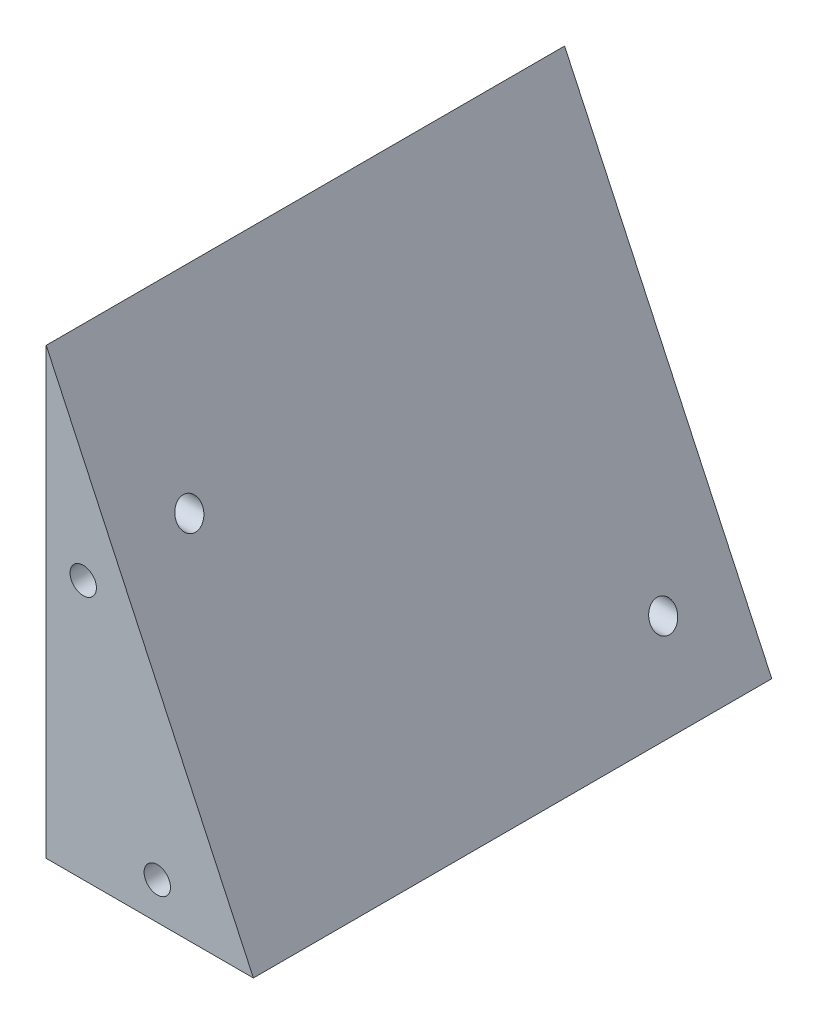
ISO-10303-21;
HEADER;
FILE_DESCRIPTION(('STEP AP214'),'2;1');
FILE_NAME('part.step','',(''),(''),'','','');
FILE_SCHEMA(('AUTOMOTIVE_DESIGN { 1 0 10303 214 1 1 1 1 }'));
ENDSEC;
DATA;
#1=APPLICATION_CONTEXT('core data for automotive mechanical design processes');
#2=APPLICATION_PROTOCOL_DEFINITION('international standard','automotive_design',2000,#1);
#3=PRODUCT_CONTEXT('',#1,'mechanical');
#4=PRODUCT('Part','Part','',(#3));
#5=PRODUCT_RELATED_PRODUCT_CATEGORY('part','',(#4));
#6=PRODUCT_DEFINITION_FORMATION('','',#4);
#7=PRODUCT_DEFINITION_CONTEXT('part definition',#1,'design');
#8=PRODUCT_DEFINITION('design','',#6,#7);
#9=PRODUCT_DEFINITION_SHAPE('','',#8);
#10=(LENGTH_UNIT() NAMED_UNIT(*) SI_UNIT(.MILLI.,.METRE.));
#11=(NAMED_UNIT(*) PLANE_ANGLE_UNIT() SI_UNIT($,.RADIAN.));
#12=(NAMED_UNIT(*) SI_UNIT($,.STERADIAN.) SOLID_ANGLE_UNIT());
#13=UNCERTAINTY_MEASURE_WITH_UNIT(LENGTH_MEASURE(1.E-05),#10,'distance_accuracy_value','');
#14=(GEOMETRIC_REPRESENTATION_CONTEXT(3) GLOBAL_UNCERTAINTY_ASSIGNED_CONTEXT((#13)) GLOBAL_UNIT_ASSIGNED_CONTEXT((#10,
#11,#12)) REPRESENTATION_CONTEXT('',''));
#15=CARTESIAN_POINT('',(0.,0.,0.));
#16=DIRECTION('',(0.,0.,1.));
#17=DIRECTION('',(1.,0.,0.));
#18=AXIS2_PLACEMENT_3D('',#15,#16,#17);
#19=CARTESIAN_POINT('',(17.7663217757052,1.04083408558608E-13,44.45));
#20=DIRECTION('',(0.,1.00000000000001,0.));
#21=DIRECTION('',(-1.00000000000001,0.,0.));
#22=AXIS2_PLACEMENT_3D('',#19,#20,#21);
#23=PLANE('',#22);
#24=DIRECTION('',(1.00000000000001,0.,0.));
#25=VECTOR('',#24,1.);
#26=CARTESIAN_POINT('',(17.7663217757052,0.,0.));
#27=LINE('',#26,#25);
#28=CARTESIAN_POINT('',(0.,0.,4.44089209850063E-13));
#29=VERTEX_POINT('',#28);
#30=CARTESIAN_POINT('',(17.7663217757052,0.,0.));
#31=VERTEX_POINT('',#30);
#32=EDGE_CURVE('E108',#29,#31,#27,.T.);
#33=ORIENTED_EDGE('',*,*,#32,.T.);
#34=DIRECTION('',(0.,0.,-1.));
#35=VECTOR('',#34,1.);
#36=CARTESIAN_POINT('',(17.7663217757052,1.04083408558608E-13,44.45));
#37=LINE('',#36,#35);
#38=CARTESIAN_POINT('',(17.7663217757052,1.04083408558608E-13,44.45));
#39=VERTEX_POINT('',#38);
#40=EDGE_CURVE('E11',#39,#31,#37,.T.);
#41=ORIENTED_EDGE('',*,*,#40,.F.);
#42=DIRECTION('',(1.00000000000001,0.,0.));
#43=VECTOR('',#42,1.);
#44=CARTESIAN_POINT('',(17.7663217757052,1.04083408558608E-13,44.45));
#45=LINE('',#44,#43);
#46=CARTESIAN_POINT('',(0.,1.04083408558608E-13,44.4500000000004));
#47=VERTEX_POINT('',#46);
#48=EDGE_CURVE('E109',#47,#39,#45,.T.);
#49=ORIENTED_EDGE('',*,*,#48,.F.);
#50=DIRECTION('',(0.,0.,-1.));
#51=VECTOR('',#50,1.);
#52=CARTESIAN_POINT('',(0.,1.04083408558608E-13,44.4500000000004));
#53=LINE('',#52,#51);
#54=EDGE_CURVE('E113',#47,#29,#53,.T.);
#55=ORIENTED_EDGE('',*,*,#54,.T.);
#56=EDGE_LOOP('',(#33,#41,#49,#55));
#57=FACE_BOUND('',#56,.T.);
#58=ADVANCED_FACE('F32',(#57),#23,.F.);
#59=CARTESIAN_POINT('',(-1.38777878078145E-13,38.1000000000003,44.45));
#60=DIRECTION('',(-0.906307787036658,-0.422618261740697,0.));
#61=DIRECTION('',(0.422618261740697,-0.906307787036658,0.));
#62=AXIS2_PLACEMENT_3D('',#59,#60,#61);
#63=PLANE('',#62);
#64=CARTESIAN_POINT('',(14.805268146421,6.34999999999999,6.35000000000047));
#65=DIRECTION('',(-0.906307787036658,-0.422618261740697,0.));
#66=DIRECTION('',(-0.422618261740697,0.906307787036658,0.));
#67=AXIS2_PLACEMENT_3D('',#64,#65,#66);
#68=ELLIPSE('',#67,1.24714806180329,1.13029999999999);
#69=CARTESIAN_POINT('',(14.2782006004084,7.48029999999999,6.35000000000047));
#70=VERTEX_POINT('',#69);
#71=EDGE_CURVE('E99',#70,#70,#68,.T.);
#72=ORIENTED_EDGE('',*,*,#71,.T.);
#73=EDGE_LOOP('',(#72));
#74=FACE_BOUND('',#73,.T.);
#75=CARTESIAN_POINT('',(5.92210725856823,25.4000000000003,38.1000000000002));
#76=DIRECTION('',(-0.906307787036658,-0.422618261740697,0.));
#77=DIRECTION('',(-0.422618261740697,0.906307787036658,0.));
#78=AXIS2_PLACEMENT_3D('',#75,#76,#77);
#79=ELLIPSE('',#78,1.24714806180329,1.13029999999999);
#80=CARTESIAN_POINT('',(5.39503971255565,26.5303000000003,38.1000000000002));
#81=VERTEX_POINT('',#80);
#82=EDGE_CURVE('E105',#81,#81,#79,.T.);
#83=ORIENTED_EDGE('',*,*,#82,.T.);
#84=EDGE_LOOP('',(#83));
#85=FACE_BOUND('',#84,.T.);
#86=DIRECTION('',(-0.422618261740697,0.906307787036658,0.));
#87=VECTOR('',#86,1.);
#88=CARTESIAN_POINT('',(-1.94289029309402E-13,38.1000000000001,0.));
#89=LINE('',#88,#87);
#90=CARTESIAN_POINT('',(-1.94289029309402E-13,38.1000000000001,0.));
#91=VERTEX_POINT('',#90);
#92=EDGE_CURVE('E61',#31,#91,#89,.T.);
#93=ORIENTED_EDGE('',*,*,#92,.T.);
#94=DIRECTION('',(0.,0.,-1.));
#95=VECTOR('',#94,1.);
#96=CARTESIAN_POINT('',(-1.38777878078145E-13,38.1000000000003,44.45));
#97=LINE('',#96,#95);
#98=CARTESIAN_POINT('',(-1.38777878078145E-13,38.1000000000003,44.45));
#99=VERTEX_POINT('',#98);
#100=EDGE_CURVE('E40',#99,#91,#97,.T.);
#101=ORIENTED_EDGE('',*,*,#100,.F.);
#102=DIRECTION('',(-0.422618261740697,0.906307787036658,0.));
#103=VECTOR('',#102,1.);
#104=CARTESIAN_POINT('',(-1.38777878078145E-13,38.1000000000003,44.45));
#105=LINE('',#104,#103);
#106=EDGE_CURVE('E69',#39,#99,#105,.T.);
#107=ORIENTED_EDGE('',*,*,#106,.F.);
#108=ORIENTED_EDGE('',*,*,#40,.T.);
#109=EDGE_LOOP('',(#93,#101,#107,#108));
#110=FACE_BOUND('',#109,.T.);
#111=ADVANCED_FACE('F135',(#74,#85,#110),#63,.F.);
#112=CARTESIAN_POINT('',(0.,1.04083408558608E-13,44.4500000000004));
#113=DIRECTION('',(1.00000000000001,0.,0.));
#114=DIRECTION('',(0.,0.,-1.));
#115=AXIS2_PLACEMENT_3D('',#112,#113,#114);
#116=PLANE('',#115);
#117=CARTESIAN_POINT('',(0.,6.34999999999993,6.35000000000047));
#118=DIRECTION('',(-1.00000000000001,0.,0.));
#119=DIRECTION('',(0.,0.,1.));
#120=AXIS2_PLACEMENT_3D('',#117,#118,#119);
#121=CIRCLE('',#120,1.13029999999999);
#122=CARTESIAN_POINT('',(0.,6.34999999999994,7.48030000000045));
#123=VERTEX_POINT('',#122);
#124=EDGE_CURVE('E96',#123,#123,#121,.T.);
#125=ORIENTED_EDGE('',*,*,#124,.F.);
#126=EDGE_LOOP('',(#125));
#127=FACE_BOUND('',#126,.T.);
#128=CARTESIAN_POINT('',(0.,25.4000000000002,38.1000000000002));
#129=DIRECTION('',(-1.00000000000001,0.,0.));
#130=DIRECTION('',(0.,0.,1.));
#131=AXIS2_PLACEMENT_3D('',#128,#129,#130);
#132=CIRCLE('',#131,1.13029999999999);
#133=CARTESIAN_POINT('',(0.,25.4000000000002,39.2303000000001));
#134=VERTEX_POINT('',#133);
#135=EDGE_CURVE('E102',#134,#134,#132,.T.);
#136=ORIENTED_EDGE('',*,*,#135,.F.);
#137=EDGE_LOOP('',(#136));
#138=FACE_BOUND('',#137,.T.);
#139=DIRECTION('',(0.,-1.00000000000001,0.));
#140=VECTOR('',#139,1.);
#141=CARTESIAN_POINT('',(0.,0.,4.44089209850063E-13));
#142=LINE('',#141,#140);
#143=EDGE_CURVE('E66',#91,#29,#142,.T.);
#144=ORIENTED_EDGE('',*,*,#143,.T.);
#145=ORIENTED_EDGE('',*,*,#54,.F.);
#146=DIRECTION('',(0.,-1.00000000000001,0.));
#147=VECTOR('',#146,1.);
#148=CARTESIAN_POINT('',(0.,1.04083408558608E-13,44.4500000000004));
#149=LINE('',#148,#147);
#150=EDGE_CURVE('E48',#99,#47,#149,.T.);
#151=ORIENTED_EDGE('',*,*,#150,.F.);
#152=ORIENTED_EDGE('',*,*,#100,.T.);
#153=EDGE_LOOP('',(#144,#145,#151,#152));
#154=FACE_BOUND('',#153,.T.);
#155=ADVANCED_FACE('F118',(#127,#138,#154),#116,.F.);
#156=CARTESIAN_POINT('',(0.,1.04083408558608E-13,44.4500000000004));
#157=DIRECTION('',(0.,0.,-1.));
#158=DIRECTION('',(-1.00000000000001,0.,0.));
#159=AXIS2_PLACEMENT_3D('',#156,#157,#158);
#160=PLANE('',#159);
#161=CARTESIAN_POINT('',(3.17499999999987,22.2250000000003,44.4500000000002));
#162=DIRECTION('',(0.,0.,1.));
#163=DIRECTION('',(1.00000000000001,0.,0.));
#164=AXIS2_PLACEMENT_3D('',#161,#162,#163);
#165=CIRCLE('',#164,1.13029999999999);
#166=CARTESIAN_POINT('',(4.30529999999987,22.2250000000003,44.4500000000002));
#167=VERTEX_POINT('',#166);
#168=EDGE_CURVE('E85',#167,#167,#165,.T.);
#169=ORIENTED_EDGE('',*,*,#168,.F.);
#170=EDGE_LOOP('',(#169));
#171=FACE_BOUND('',#170,.T.);
#172=CARTESIAN_POINT('',(9.52499999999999,3.17500000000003,44.4500000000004));
#173=DIRECTION('',(0.,0.,1.));
#174=DIRECTION('',(1.00000000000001,0.,0.));
#175=AXIS2_PLACEMENT_3D('',#172,#173,#174);
#176=CIRCLE('',#175,1.13029999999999);
#177=CARTESIAN_POINT('',(10.6553,3.17500000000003,44.4500000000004));
#178=VERTEX_POINT('',#177);
#179=EDGE_CURVE('E93',#178,#178,#176,.T.);
#180=ORIENTED_EDGE('',*,*,#179,.F.);
#181=EDGE_LOOP('',(#180));
#182=FACE_BOUND('',#181,.T.);
#183=ORIENTED_EDGE('',*,*,#48,.T.);
#184=ORIENTED_EDGE('',*,*,#106,.T.);
#185=ORIENTED_EDGE('',*,*,#150,.T.);
#186=EDGE_LOOP('',(#183,#184,#185));
#187=FACE_BOUND('',#186,.T.);
#188=ADVANCED_FACE('F125',(#171,#182,#187),#160,.F.);
#189=CARTESIAN_POINT('',(0.,0.,4.44089209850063E-13));
#190=DIRECTION('',(0.,0.,-1.));
#191=DIRECTION('',(-1.00000000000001,0.,0.));
#192=AXIS2_PLACEMENT_3D('',#189,#190,#191);
#193=PLANE('',#192);
#194=ORIENTED_EDGE('',*,*,#32,.F.);
#195=ORIENTED_EDGE('',*,*,#143,.F.);
#196=ORIENTED_EDGE('',*,*,#92,.F.);
#197=EDGE_LOOP('',(#194,#195,#196));
#198=FACE_BOUND('',#197,.T.);
#199=ADVANCED_FACE('F121',(#198),#193,.T.);
#200=CARTESIAN_POINT('',(0.,25.4000000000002,38.1000000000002));
#201=DIRECTION('',(-1.00000000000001,0.,0.));
#202=DIRECTION('',(0.,0.,1.));
#203=AXIS2_PLACEMENT_3D('',#200,#201,#202);
#204=CYLINDRICAL_SURFACE('',#203,1.13029999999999);
#205=ORIENTED_EDGE('',*,*,#135,.T.);
#206=EDGE_LOOP('',(#205));
#207=FACE_BOUND('',#206,.T.);
#208=ORIENTED_EDGE('',*,*,#82,.F.);
#209=EDGE_LOOP('',(#208));
#210=FACE_BOUND('',#209,.T.);
#211=ADVANCED_FACE('F133',(#207,#210),#204,.F.);
#212=CARTESIAN_POINT('',(0.,6.34999999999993,6.35000000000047));
#213=DIRECTION('',(-1.00000000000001,0.,0.));
#214=DIRECTION('',(0.,0.,1.));
#215=AXIS2_PLACEMENT_3D('',#212,#213,#214);
#216=CYLINDRICAL_SURFACE('',#215,1.13029999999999);
#217=ORIENTED_EDGE('',*,*,#124,.T.);
#218=EDGE_LOOP('',(#217));
#219=FACE_BOUND('',#218,.T.);
#220=ORIENTED_EDGE('',*,*,#71,.F.);
#221=EDGE_LOOP('',(#220));
#222=FACE_BOUND('',#221,.T.);
#223=ADVANCED_FACE('F153',(#219,#222),#216,.F.);
#224=CARTESIAN_POINT('',(9.52499999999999,3.17500000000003,44.4500000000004));
#225=DIRECTION('',(0.,0.,1.));
#226=DIRECTION('',(1.00000000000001,0.,0.));
#227=AXIS2_PLACEMENT_3D('',#224,#225,#226);
#228=CYLINDRICAL_SURFACE('',#227,1.13029999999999);
#229=CARTESIAN_POINT('',(9.52499999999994,3.17500000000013,31.7500000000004));
#230=DIRECTION('',(0.,0.,1.));
#231=DIRECTION('',(1.00000000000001,0.,0.));
#232=AXIS2_PLACEMENT_3D('',#229,#230,#231);
#233=CIRCLE('',#232,1.1303);
#234=CARTESIAN_POINT('',(10.6552999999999,3.17500000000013,31.7500000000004));
#235=VERTEX_POINT('',#234);
#236=EDGE_CURVE('E88',#235,#235,#233,.T.);
#237=ORIENTED_EDGE('',*,*,#236,.F.);
#238=EDGE_LOOP('',(#237));
#239=FACE_BOUND('',#238,.T.);
#240=ORIENTED_EDGE('',*,*,#179,.T.);
#241=EDGE_LOOP('',(#240));
#242=FACE_BOUND('',#241,.T.);
#243=ADVANCED_FACE('F158',(#239,#242),#228,.F.);
#244=CARTESIAN_POINT('',(9.52499999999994,3.17500000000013,31.7500000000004));
#245=DIRECTION('',(0.,0.,1.));
#246=DIRECTION('',(1.00000000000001,0.,0.));
#247=AXIS2_PLACEMENT_3D('',#244,#245,#246);
#248=CONICAL_SURFACE('',#247,1.1303,1.02974425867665);
#249=CARTESIAN_POINT('',(9.52499999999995,3.17500000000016,31.0708472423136));
#250=VERTEX_POINT('',#249);
#251=VERTEX_LOOP('',#250);
#252=FACE_BOUND('',#251,.T.);
#253=ORIENTED_EDGE('',*,*,#236,.T.);
#254=EDGE_LOOP('',(#253));
#255=FACE_BOUND('',#254,.T.);
#256=ADVANCED_FACE('F164',(#252,#255),#248,.F.);
#257=CARTESIAN_POINT('',(3.17499999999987,22.2250000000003,44.4500000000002));
#258=DIRECTION('',(0.,0.,1.));
#259=DIRECTION('',(1.00000000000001,0.,0.));
#260=AXIS2_PLACEMENT_3D('',#257,#258,#259);
#261=CYLINDRICAL_SURFACE('',#260,1.13029999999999);
#262=CARTESIAN_POINT('',(3.1749999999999,22.2250000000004,31.7500000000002));
#263=DIRECTION('',(0.,0.,1.));
#264=DIRECTION('',(1.00000000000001,0.,0.));
#265=AXIS2_PLACEMENT_3D('',#262,#263,#264);
#266=CIRCLE('',#265,1.1303);
#267=CARTESIAN_POINT('',(4.30529999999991,22.2250000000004,31.7500000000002));
#268=VERTEX_POINT('',#267);
#269=EDGE_CURVE('E83',#268,#268,#266,.T.);
#270=ORIENTED_EDGE('',*,*,#269,.F.);
#271=EDGE_LOOP('',(#270));
#272=FACE_BOUND('',#271,.T.);
#273=ORIENTED_EDGE('',*,*,#168,.T.);
#274=EDGE_LOOP('',(#273));
#275=FACE_BOUND('',#274,.T.);
#276=ADVANCED_FACE('F79',(#272,#275),#261,.F.);
#277=CARTESIAN_POINT('',(3.1749999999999,22.2250000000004,31.7500000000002));
#278=DIRECTION('',(0.,0.,1.));
#279=DIRECTION('',(1.00000000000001,0.,0.));
#280=AXIS2_PLACEMENT_3D('',#277,#278,#279);
#281=CONICAL_SURFACE('',#280,1.1303,1.02974425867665);
#282=CARTESIAN_POINT('',(3.17499999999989,22.2250000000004,31.0708472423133));
#283=VERTEX_POINT('',#282);
#284=VERTEX_LOOP('',#283);
#285=FACE_BOUND('',#284,.T.);
#286=ORIENTED_EDGE('',*,*,#269,.T.);
#287=EDGE_LOOP('',(#286));
#288=FACE_BOUND('',#287,.T.);
#289=ADVANCED_FACE('F76',(#285,#288),#281,.F.);
#290=CLOSED_SHELL('',(#58,#111,#155,#188,#199,#211,#223,#243,#256,#276,#289));
#291=MANIFOLD_SOLID_BREP('B2',#290);
#292=ADVANCED_BREP_SHAPE_REPRESENTATION('',(#18,#291),#14);
#293=SHAPE_DEFINITION_REPRESENTATION(#9,#292);
ENDSEC;
END-ISO-10303-21;
